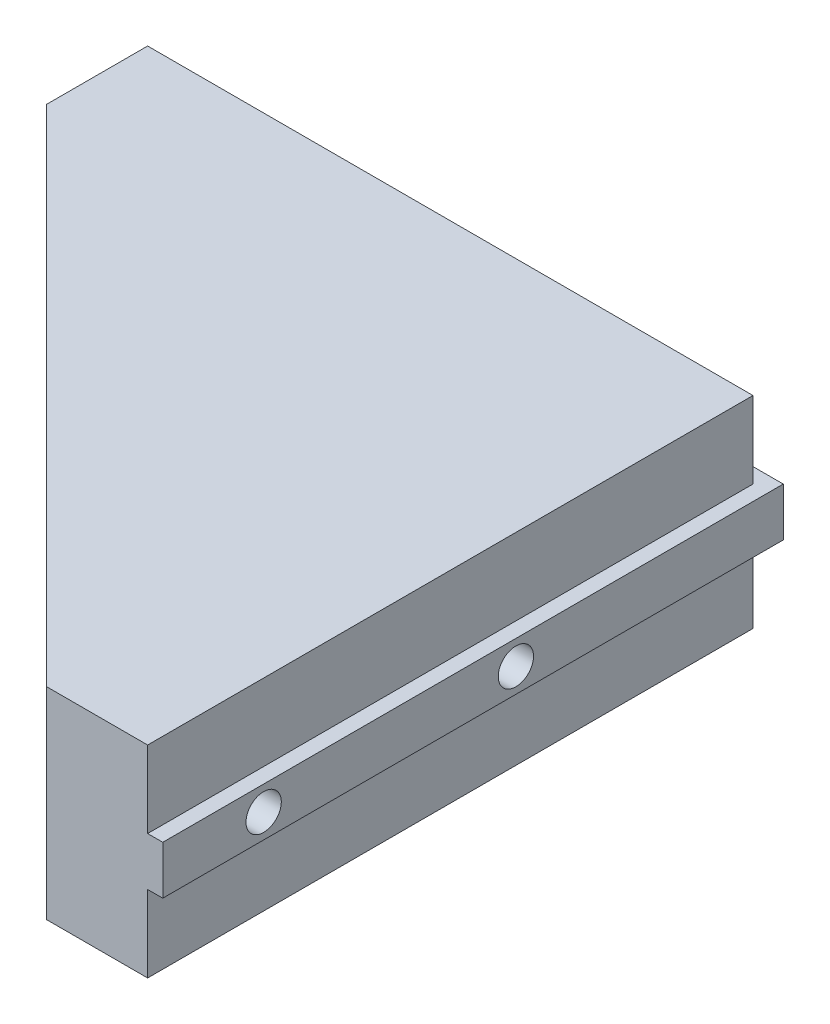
from build123d import *

# Parameters (mm, degrees)
AUFSATZ_LINEAR_AUSTRAGEN1_DEPTH  = 10
AUFSATZ_LINEAR_AUSTRAGEN2_DEPTH  = 2.4
F_3_5_3_5_DURCHMESSER_BOHRUNG1_D = 3.5
F_3_5_3_5_DURCHMESSER_BOHRUNG2_D = 3.5
SKIZZE7_R                        = 3.5
SCHNITT_LINEAR_AUSTRAGEN1_DEPTH  = 82.007715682
SKIZZE8_R                        = 3.5
SCHNITT_LINEAR_AUSTRAGEN2_DEPTH  = 82.007715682
AUFSATZ_LINEAR_AUSTRAGEN3_DEPTH  = 6


with BuildPart() as part:
    # Skizze1 → Aufsatz-Linear austragen1 (new, symmetric)
    with BuildSketch(Plane(origin=(0, 0, 0), x_dir=(1, 0, 0), z_dir=(0, 1, 0))):
        Polygon((-60, 0), (0, 0), (0, -60), (-10, -60), (-10, -20), (-20, -10), (-60, -10), align=None)
    extrude(amount=AUFSATZ_LINEAR_AUSTRAGEN1_DEPTH, both=True)

    # Skizze2 → Aufsatz-Linear austragen2 (add, symmetric)
    with BuildSketch(Plane(origin=(0, 0, 0), x_dir=(1, 0, 0), z_dir=(0, 1, 0))):
        Polygon((0, 0), (-60, 0), (-60, 1.5), (1.5, 1.5), (1.5, -60), (0, -60), align=None)
    extrude(amount=AUFSATZ_LINEAR_AUSTRAGEN2_DEPTH, both=True)

    # 3.5 _3.5_ Durchmesser Bohrung1 (through all)
    with Locations(Plane(origin=(1.5, 0, 0), x_dir=(0, 0, -1), z_dir=(1, 0, 0))):
        with Locations((-50, 0), (-25, 0)):
            Hole(F_3_5_3_5_DURCHMESSER_BOHRUNG1_D / 2)

    # 3.5 _3.5_ Durchmesser Bohrung2 (through all)
    with Locations(Plane(origin=(0, 0, -1.5), x_dir=(-1, 0, 0), z_dir=(0, 0, -1))):
        with Locations((50, 0), (25, 0)):
            Hole(F_3_5_3_5_DURCHMESSER_BOHRUNG2_D / 2)

    # Skizze7 → Schnitt-Linear austragen1 (cut, through all)
    with BuildSketch(Plane(origin=(-6.5, 0, 0), x_dir=(0, 0, -1), z_dir=(1, 0, 0))):
        with Locations((-50, 0)):
            Circle(SKIZZE7_R)
        with Locations((-25, 0)):
            Circle(SKIZZE7_R)
    extrude(amount=-SCHNITT_LINEAR_AUSTRAGEN1_DEPTH, mode=Mode.SUBTRACT)

    # Skizze8 → Schnitt-Linear austragen2 (cut, through all)
    with BuildSketch(Plane(origin=(0, 0, 6.5), x_dir=(-1, 0, 0), z_dir=(0, 0, -1))):
        with Locations((25, 0)):
            Circle(SKIZZE8_R)
        with Locations((50, 0)):
            Circle(SKIZZE8_R)
    extrude(amount=-SCHNITT_LINEAR_AUSTRAGEN2_DEPTH, mode=Mode.SUBTRACT)

    # Skizze9 → Aufsatz-Linear austragen3 (add)
    with BuildSketch(Plane(origin=(0, 10, 0), x_dir=(1, 0, 0), z_dir=(0, 1, 0))):
        Polygon((-60, -10), (-10, -60), (-10, -20), (-20, -10), align=None)
    extrude(amount=-AUFSATZ_LINEAR_AUSTRAGEN3_DEPTH)


solid = part.part
